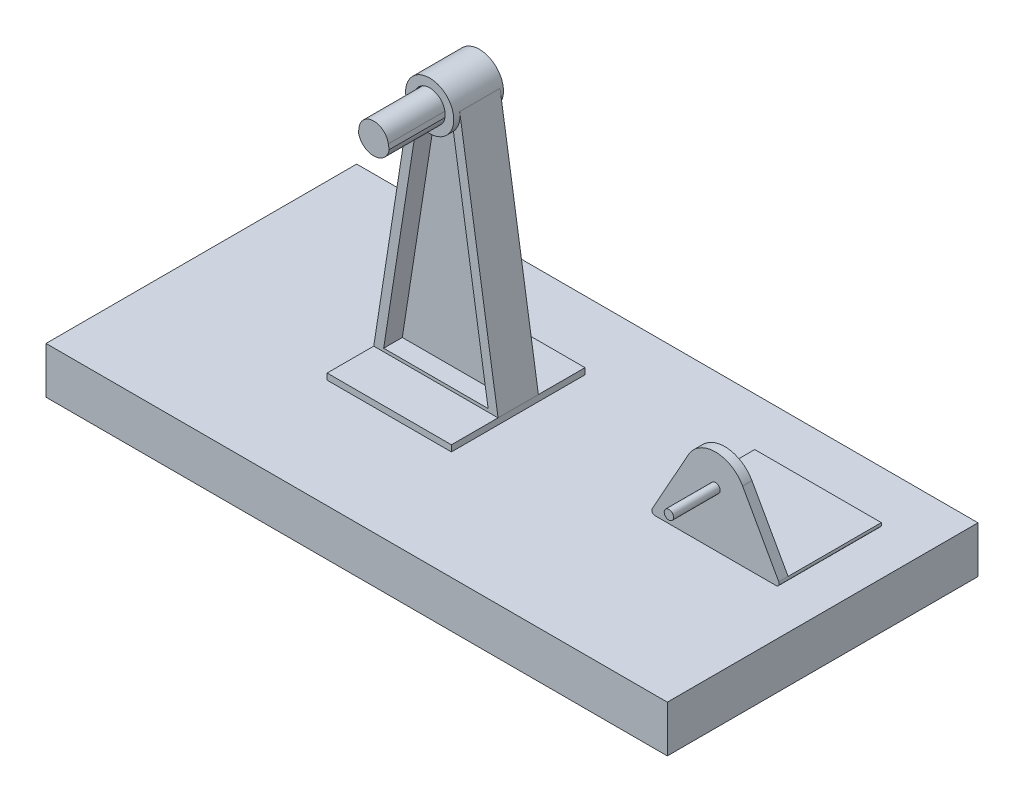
ISO-10303-21;
HEADER;
FILE_DESCRIPTION(('STEP AP214'),'2;1');
FILE_NAME('part.step','',(''),(''),'','','');
FILE_SCHEMA(('AUTOMOTIVE_DESIGN { 1 0 10303 214 1 1 1 1 }'));
ENDSEC;
DATA;
#1=APPLICATION_CONTEXT('core data for automotive mechanical design processes');
#2=APPLICATION_PROTOCOL_DEFINITION('international standard','automotive_design',2000,#1);
#3=PRODUCT_CONTEXT('',#1,'mechanical');
#4=PRODUCT('Part','Part','',(#3));
#5=PRODUCT_RELATED_PRODUCT_CATEGORY('part','',(#4));
#6=PRODUCT_DEFINITION_FORMATION('','',#4);
#7=PRODUCT_DEFINITION_CONTEXT('part definition',#1,'design');
#8=PRODUCT_DEFINITION('design','',#6,#7);
#9=PRODUCT_DEFINITION_SHAPE('','',#8);
#10=(LENGTH_UNIT() NAMED_UNIT(*) SI_UNIT(.MILLI.,.METRE.));
#11=(NAMED_UNIT(*) PLANE_ANGLE_UNIT() SI_UNIT($,.RADIAN.));
#12=(NAMED_UNIT(*) SI_UNIT($,.STERADIAN.) SOLID_ANGLE_UNIT());
#13=UNCERTAINTY_MEASURE_WITH_UNIT(LENGTH_MEASURE(1.E-05),#10,'distance_accuracy_value','');
#14=(GEOMETRIC_REPRESENTATION_CONTEXT(3) GLOBAL_UNCERTAINTY_ASSIGNED_CONTEXT((#13)) GLOBAL_UNIT_ASSIGNED_CONTEXT((#10,
#11,#12)) REPRESENTATION_CONTEXT('',''));
#15=CARTESIAN_POINT('',(0.,0.,0.));
#16=DIRECTION('',(0.,0.,1.));
#17=DIRECTION('',(1.,0.,0.));
#18=AXIS2_PLACEMENT_3D('',#15,#16,#17);
#19=CARTESIAN_POINT('',(-100.,7.5,50.));
#20=DIRECTION('',(0.,-1.,0.));
#21=DIRECTION('',(0.,0.,-1.));
#22=AXIS2_PLACEMENT_3D('',#19,#20,#21);
#23=PLANE('',#22);
#24=DIRECTION('',(-1.,0.,0.));
#25=VECTOR('',#24,1.);
#26=CARTESIAN_POINT('',(-100.,7.5,-50.));
#27=LINE('',#26,#25);
#28=CARTESIAN_POINT('',(100.,7.5,-50.));
#29=VERTEX_POINT('',#28);
#30=CARTESIAN_POINT('',(-100.,7.5,-50.));
#31=VERTEX_POINT('',#30);
#32=EDGE_CURVE('E660',#29,#31,#27,.T.);
#33=ORIENTED_EDGE('',*,*,#32,.T.);
#34=DIRECTION('',(0.,0.,-1.));
#35=VECTOR('',#34,1.);
#36=CARTESIAN_POINT('',(-100.,7.5,50.));
#37=LINE('',#36,#35);
#38=CARTESIAN_POINT('',(-100.,7.5,50.));
#39=VERTEX_POINT('',#38);
#40=EDGE_CURVE('E675',#39,#31,#37,.T.);
#41=ORIENTED_EDGE('',*,*,#40,.F.);
#42=DIRECTION('',(-1.,0.,0.));
#43=VECTOR('',#42,1.);
#44=CARTESIAN_POINT('',(-100.,7.5,50.));
#45=LINE('',#44,#43);
#46=CARTESIAN_POINT('',(100.,7.5,50.));
#47=VERTEX_POINT('',#46);
#48=EDGE_CURVE('E646',#47,#39,#45,.T.);
#49=ORIENTED_EDGE('',*,*,#48,.F.);
#50=DIRECTION('',(0.,0.,-1.));
#51=VECTOR('',#50,1.);
#52=CARTESIAN_POINT('',(100.,7.5,50.));
#53=LINE('',#52,#51);
#54=EDGE_CURVE('E679',#47,#29,#53,.T.);
#55=ORIENTED_EDGE('',*,*,#54,.T.);
#56=EDGE_LOOP('',(#33,#41,#49,#55));
#57=FACE_BOUND('',#56,.T.);
#58=DIRECTION('',(0.,0.,1.));
#59=VECTOR('',#58,1.);
#60=CARTESIAN_POINT('',(46.,7.5,-3.));
#61=LINE('',#60,#59);
#62=CARTESIAN_POINT('',(46.,7.5,-33.));
#63=VERTEX_POINT('',#62);
#64=CARTESIAN_POINT('',(46.,7.5,0.));
#65=VERTEX_POINT('',#64);
#66=EDGE_CURVE('E633',#63,#65,#61,.T.);
#67=ORIENTED_EDGE('',*,*,#66,.F.);
#68=DIRECTION('',(-1.,0.,0.));
#69=VECTOR('',#68,1.);
#70=CARTESIAN_POINT('',(46.,7.5,-33.));
#71=LINE('',#70,#69);
#72=CARTESIAN_POINT('',(85.,7.50000000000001,-33.));
#73=VERTEX_POINT('',#72);
#74=EDGE_CURVE('E573',#73,#63,#71,.T.);
#75=ORIENTED_EDGE('',*,*,#74,.F.);
#76=DIRECTION('',(0.,0.,1.));
#77=VECTOR('',#76,1.);
#78=CARTESIAN_POINT('',(85.,7.5,-3.));
#79=LINE('',#78,#77);
#80=CARTESIAN_POINT('',(85.,7.5,0.));
#81=VERTEX_POINT('',#80);
#82=EDGE_CURVE('E630',#73,#81,#79,.T.);
#83=ORIENTED_EDGE('',*,*,#82,.T.);
#84=DIRECTION('',(1.,0.,0.));
#85=VECTOR('',#84,1.);
#86=CARTESIAN_POINT('',(85.,7.5,0.));
#87=LINE('',#86,#85);
#88=EDGE_CURVE('E612',#65,#81,#87,.T.);
#89=ORIENTED_EDGE('',*,*,#88,.F.);
#90=EDGE_LOOP('',(#67,#75,#83,#89));
#91=FACE_BOUND('',#90,.T.);
#92=DIRECTION('',(-1.,0.,0.));
#93=VECTOR('',#92,1.);
#94=CARTESIAN_POINT('',(-4.49999999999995,7.50000000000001,-28.));
#95=LINE('',#94,#93);
#96=CARTESIAN_POINT('',(-4.49999999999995,7.5,-28.));
#97=VERTEX_POINT('',#96);
#98=CARTESIAN_POINT('',(-44.5,7.5,-28.));
#99=VERTEX_POINT('',#98);
#100=EDGE_CURVE('E292',#97,#99,#95,.T.);
#101=ORIENTED_EDGE('',*,*,#100,.F.);
#102=DIRECTION('',(0.,0.,1.));
#103=VECTOR('',#102,1.);
#104=CARTESIAN_POINT('',(-4.49999999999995,7.50000000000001,-13.));
#105=LINE('',#104,#103);
#106=CARTESIAN_POINT('',(-4.49999999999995,7.50000000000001,15.));
#107=VERTEX_POINT('',#106);
#108=EDGE_CURVE('E99',#97,#107,#105,.T.);
#109=ORIENTED_EDGE('',*,*,#108,.T.);
#110=DIRECTION('',(1.,0.,0.));
#111=VECTOR('',#110,1.);
#112=CARTESIAN_POINT('',(-44.5,7.50000000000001,15.));
#113=LINE('',#112,#111);
#114=CARTESIAN_POINT('',(-44.5,7.50000000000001,15.));
#115=VERTEX_POINT('',#114);
#116=EDGE_CURVE('E326',#115,#107,#113,.T.);
#117=ORIENTED_EDGE('',*,*,#116,.F.);
#118=DIRECTION('',(0.,0.,1.));
#119=VECTOR('',#118,1.);
#120=CARTESIAN_POINT('',(-44.5,7.5,-13.));
#121=LINE('',#120,#119);
#122=EDGE_CURVE('E91',#99,#115,#121,.T.);
#123=ORIENTED_EDGE('',*,*,#122,.F.);
#124=EDGE_LOOP('',(#101,#109,#117,#123));
#125=FACE_BOUND('',#124,.T.);
#126=ADVANCED_FACE('F74',(#57,#91,#125),#23,.F.);
#127=CARTESIAN_POINT('',(0.,0.,-13.));
#128=DIRECTION('',(0.,0.,1.));
#129=DIRECTION('',(1.,0.,0.));
#130=AXIS2_PLACEMENT_3D('',#127,#128,#129);
#131=PLANE('',#130);
#132=DIRECTION('',(0.153992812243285,0.98807196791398,0.));
#133=VECTOR('',#132,1.);
#134=CARTESIAN_POINT('',(-41.3079320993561,10.5,-13.));
#135=LINE('',#134,#133);
#136=CARTESIAN_POINT('',(-41.3079320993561,10.5,-13.));
#137=VERTEX_POINT('',#136);
#138=CARTESIAN_POINT('',(-30.6783911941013,78.702867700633,-13.));
#139=VERTEX_POINT('',#138);
#140=EDGE_CURVE('E451',#137,#139,#135,.T.);
#141=ORIENTED_EDGE('',*,*,#140,.F.);
#142=DIRECTION('',(-1.,0.,0.));
#143=VECTOR('',#142,1.);
#144=CARTESIAN_POINT('',(-7.69206790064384,10.5,-13.));
#145=LINE('',#144,#143);
#146=CARTESIAN_POINT('',(-7.69206790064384,10.5,-13.));
#147=VERTEX_POINT('',#146);
#148=EDGE_CURVE('E429',#147,#137,#145,.T.);
#149=ORIENTED_EDGE('',*,*,#148,.F.);
#150=DIRECTION('',(0.1539928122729,-0.988071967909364,0.));
#151=VECTOR('',#150,1.);
#152=CARTESIAN_POINT('',(-18.3216088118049,78.7028677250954,-13.));
#153=LINE('',#152,#151);
#154=CARTESIAN_POINT('',(-18.3216088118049,78.7028677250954,-13.));
#155=VERTEX_POINT('',#154);
#156=EDGE_CURVE('E404',#155,#147,#153,.T.);
#157=ORIENTED_EDGE('',*,*,#156,.F.);
#158=CARTESIAN_POINT('',(-30.6783911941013,78.702867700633,-13.));
#159=CARTESIAN_POINT('',(-30.4815497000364,78.5646307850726,-13.));
#160=CARTESIAN_POINT('',(-30.2808441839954,78.4318933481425,-13.));
#161=CARTESIAN_POINT('',(-30.076484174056,78.3047948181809,-13.));
#162=CARTESIAN_POINT('',(-29.5436230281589,77.9937011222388,-13.));
#163=CARTESIAN_POINT('',(-28.9894878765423,77.7215185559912,-13.));
#164=CARTESIAN_POINT('',(-28.6444176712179,77.5703471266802,-13.));
#165=CARTESIAN_POINT('',(-27.9419646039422,77.2985066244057,-13.));
#166=CARTESIAN_POINT('',(-27.2184067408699,77.0892135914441,-13.));
#167=CARTESIAN_POINT('',(-26.8522861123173,77.0004305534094,-13.));
#168=CARTESIAN_POINT('',(-26.1132304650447,76.8550446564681,-13.));
#169=CARTESIAN_POINT('',(-25.3642840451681,76.7749255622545,-13.));
#170=CARTESIAN_POINT('',(-24.988297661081,76.7512431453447,-13.));
#171=CARTESIAN_POINT('',(-24.2352175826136,76.7367534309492,-13.));
#172=CARTESIAN_POINT('',(-23.4837609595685,76.788255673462,-13.));
#173=CARTESIAN_POINT('',(-23.1093938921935,76.8303972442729,-13.));
#174=CARTESIAN_POINT('',(-22.3652930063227,76.9472462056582,-13.));
#175=CARTESIAN_POINT('',(-21.6342801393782,77.1287966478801,-13.));
#176=CARTESIAN_POINT('',(-21.2729679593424,77.2354749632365,-13.));
#177=CARTESIAN_POINT('',(-20.5605766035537,77.4800932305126,-13.));
#178=CARTESIAN_POINT('',(-19.87234025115,77.7861456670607,-13.));
#179=CARTESIAN_POINT('',(-19.5351208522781,77.9541018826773,-13.));
#180=CARTESIAN_POINT('',(-19.0876481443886,78.2019155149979,-13.));
#181=CARTESIAN_POINT('',(-18.6560746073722,78.4756894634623,-13.));
#182=CARTESIAN_POINT('',(-18.5433970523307,78.549671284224,-13.));
#183=CARTESIAN_POINT('',(-18.431896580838,78.6254061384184,-13.));
#184=CARTESIAN_POINT('',(-18.3216088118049,78.7028677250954,-13.));
#185=B_SPLINE_CURVE_WITH_KNOTS('',5,(#158,#159,#160,#161,#162,#163,#164,#165,#166,#167,#168,
#169,#170,#171,#172,#173,#174,#175,#176,#177,#178,#179,#180,#181,#182,#183,#184),.UNSPECIFIED.,
.F.,.F.,(6,3,3,3,3,3,3,3,6),(0.,0.0913598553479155,0.234268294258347,0.377176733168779,
0.520085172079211,0.662993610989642,0.805902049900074,0.948810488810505,1.),.UNSPECIFIED.);
#186=EDGE_CURVE('E391',#139,#155,#185,.T.);
#187=ORIENTED_EDGE('',*,*,#186,.F.);
#188=EDGE_LOOP('',(#141,#149,#157,#187));
#189=FACE_BOUND('',#188,.T.);
#190=DIRECTION('',(1.,0.,0.));
#191=VECTOR('',#190,1.);
#192=CARTESIAN_POINT('',(-4.49999999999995,9.5,-13.));
#193=LINE('',#192,#191);
#194=CARTESIAN_POINT('',(-44.5,9.5,-13.));
#195=VERTEX_POINT('',#194);
#196=CARTESIAN_POINT('',(-4.49999999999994,9.50000000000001,-13.));
#197=VERTEX_POINT('',#196);
#198=EDGE_CURVE('E318',#195,#197,#193,.T.);
#199=ORIENTED_EDGE('',*,*,#198,.F.);
#200=DIRECTION('',(0.153992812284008,0.988071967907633,0.));
#201=VECTOR('',#200,1.);
#202=CARTESIAN_POINT('',(-44.8902183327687,6.99622212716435,-13.));
#203=LINE('',#202,#201);
#204=CARTESIAN_POINT('',(-32.1575577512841,88.6934442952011,-13.));
#205=VERTEX_POINT('',#204);
#206=EDGE_CURVE('E525',#195,#205,#203,.T.);
#207=ORIENTED_EDGE('',*,*,#206,.T.);
#208=CARTESIAN_POINT('',(-24.5,87.5,-13.));
#209=DIRECTION('',(0.,0.,1.));
#210=DIRECTION('',(1.,0.,0.));
#211=AXIS2_PLACEMENT_3D('',#208,#209,#210);
#212=CIRCLE('',#211,7.75000000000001);
#213=CARTESIAN_POINT('',(-16.8424422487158,88.6934442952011,-13.));
#214=VERTEX_POINT('',#213);
#215=EDGE_CURVE('E486',#205,#214,#212,.T.);
#216=ORIENTED_EDGE('',*,*,#215,.T.);
#217=DIRECTION('',(0.153992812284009,-0.988071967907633,0.));
#218=VECTOR('',#217,1.);
#219=CARTESIAN_POINT('',(-2.94780614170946,-0.459420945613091,-13.));
#220=LINE('',#219,#218);
#221=EDGE_CURVE('E529',#214,#197,#220,.T.);
#222=ORIENTED_EDGE('',*,*,#221,.T.);
#223=EDGE_LOOP('',(#199,#207,#216,#222));
#224=FACE_BOUND('',#223,.T.);
#225=ADVANCED_FACE('F720',(#189,#224),#131,.F.);
#226=CARTESIAN_POINT('',(0.,0.,0.));
#227=DIRECTION('',(0.,0.,1.));
#228=DIRECTION('',(1.,0.,0.));
#229=AXIS2_PLACEMENT_3D('',#226,#227,#228);
#230=PLANE('',#229);
#231=DIRECTION('',(0.153992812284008,0.988071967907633,0.));
#232=VECTOR('',#231,1.);
#233=CARTESIAN_POINT('',(-44.8902183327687,6.99622212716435,0.));
#234=LINE('',#233,#232);
#235=CARTESIAN_POINT('',(-44.5,9.5,0.));
#236=VERTEX_POINT('',#235);
#237=CARTESIAN_POINT('',(-32.1575577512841,88.6934442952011,0.));
#238=VERTEX_POINT('',#237);
#239=EDGE_CURVE('E521',#236,#238,#234,.T.);
#240=ORIENTED_EDGE('',*,*,#239,.F.);
#241=DIRECTION('',(-1.,0.,0.));
#242=VECTOR('',#241,1.);
#243=CARTESIAN_POINT('',(-44.5,9.5,0.));
#244=LINE('',#243,#242);
#245=CARTESIAN_POINT('',(-4.49999999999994,9.50000000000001,0.));
#246=VERTEX_POINT('',#245);
#247=EDGE_CURVE('E307',#246,#236,#244,.T.);
#248=ORIENTED_EDGE('',*,*,#247,.F.);
#249=DIRECTION('',(0.153992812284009,-0.988071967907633,0.));
#250=VECTOR('',#249,1.);
#251=CARTESIAN_POINT('',(-2.94780614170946,-0.459420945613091,0.));
#252=LINE('',#251,#250);
#253=CARTESIAN_POINT('',(-16.8424422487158,88.6934442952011,0.));
#254=VERTEX_POINT('',#253);
#255=EDGE_CURVE('E530',#254,#246,#252,.T.);
#256=ORIENTED_EDGE('',*,*,#255,.F.);
#257=CARTESIAN_POINT('',(-24.5,87.5,0.));
#258=DIRECTION('',(0.,0.,1.));
#259=DIRECTION('',(1.,0.,0.));
#260=AXIS2_PLACEMENT_3D('',#257,#258,#259);
#261=CIRCLE('',#260,7.75000000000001);
#262=CARTESIAN_POINT('',(-18.8636486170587,82.1807854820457,0.));
#263=VERTEX_POINT('',#262);
#264=EDGE_CURVE('E481',#263,#254,#261,.T.);
#265=ORIENTED_EDGE('',*,*,#264,.F.);
#266=DIRECTION('',(-0.153992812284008,0.988071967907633,0.));
#267=VECTOR('',#266,1.);
#268=CARTESIAN_POINT('',(-7.69206790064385,10.5,0.));
#269=LINE('',#268,#267);
#270=CARTESIAN_POINT('',(-7.69206790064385,10.5,0.));
#271=VERTEX_POINT('',#270);
#272=EDGE_CURVE('E494',#271,#263,#269,.T.);
#273=ORIENTED_EDGE('',*,*,#272,.F.);
#274=DIRECTION('',(1.,0.,0.));
#275=VECTOR('',#274,1.);
#276=CARTESIAN_POINT('',(-41.3079320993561,10.5,0.));
#277=LINE('',#276,#275);
#278=CARTESIAN_POINT('',(-41.3079320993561,10.5,0.));
#279=VERTEX_POINT('',#278);
#280=EDGE_CURVE('E510',#279,#271,#277,.T.);
#281=ORIENTED_EDGE('',*,*,#280,.F.);
#282=DIRECTION('',(-0.153992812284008,-0.988071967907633,0.));
#283=VECTOR('',#282,1.);
#284=CARTESIAN_POINT('',(-29.1933418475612,88.231465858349,0.));
#285=LINE('',#284,#283);
#286=CARTESIAN_POINT('',(-30.1363513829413,82.1807854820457,0.));
#287=VERTEX_POINT('',#286);
#288=EDGE_CURVE('E505',#287,#279,#285,.T.);
#289=ORIENTED_EDGE('',*,*,#288,.F.);
#290=EDGE_CURVE('E485',#238,#287,#261,.T.);
#291=ORIENTED_EDGE('',*,*,#290,.F.);
#292=EDGE_LOOP('',(#240,#248,#256,#265,#273,#281,#289,#291));
#293=FACE_BOUND('',#292,.T.);
#294=ADVANCED_FACE('F712',(#293),#230,.T.);
#295=CARTESIAN_POINT('',(-24.5,87.5,-14.));
#296=DIRECTION('',(0.,0.,1.));
#297=DIRECTION('',(1.,0.,0.));
#298=AXIS2_PLACEMENT_3D('',#295,#296,#297);
#299=CYLINDRICAL_SURFACE('',#298,5.);
#300=DIRECTION('',(0.,0.,-1.));
#301=VECTOR('',#300,1.);
#302=CARTESIAN_POINT('',(-29.4337630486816,86.6888389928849,20.));
#303=LINE('',#302,#301);
#304=CARTESIAN_POINT('',(-29.4337630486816,86.6888389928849,2.));
#305=VERTEX_POINT('',#304);
#306=CARTESIAN_POINT('',(-29.4337630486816,86.6888389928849,0.));
#307=VERTEX_POINT('',#306);
#308=EDGE_CURVE('E366',#305,#307,#303,.T.);
#309=ORIENTED_EDGE('',*,*,#308,.T.);
#310=CARTESIAN_POINT('',(-24.5,87.5,0.));
#311=DIRECTION('',(0.,0.,1.));
#312=DIRECTION('',(1.,0.,0.));
#313=AXIS2_PLACEMENT_3D('',#310,#311,#312);
#314=CIRCLE('',#313,5.);
#315=CARTESIAN_POINT('',(-19.5662369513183,86.6888389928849,0.));
#316=VERTEX_POINT('',#315);
#317=EDGE_CURVE('E470',#316,#307,#314,.T.);
#318=ORIENTED_EDGE('',*,*,#317,.F.);
#319=DIRECTION('',(0.,0.,-1.));
#320=VECTOR('',#319,1.);
#321=CARTESIAN_POINT('',(-19.5662369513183,86.6888389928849,20.));
#322=LINE('',#321,#320);
#323=CARTESIAN_POINT('',(-19.5662369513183,86.6888389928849,2.));
#324=VERTEX_POINT('',#323);
#325=EDGE_CURVE('E361',#324,#316,#322,.T.);
#326=ORIENTED_EDGE('',*,*,#325,.F.);
#327=CARTESIAN_POINT('',(-24.5,87.5,2.));
#328=DIRECTION('',(0.,0.,1.));
#329=DIRECTION('',(1.,0.,0.));
#330=AXIS2_PLACEMENT_3D('',#327,#328,#329);
#331=CIRCLE('',#330,5.);
#332=EDGE_CURVE('E396',#324,#305,#331,.T.);
#333=ORIENTED_EDGE('',*,*,#332,.T.);
#334=EDGE_LOOP('',(#309,#318,#326,#333));
#335=FACE_BOUND('',#334,.T.);
#336=ADVANCED_FACE('F741',(#335),#299,.F.);
#337=CARTESIAN_POINT('',(65.5,25.,-3.));
#338=DIRECTION('',(0.,0.,-1.));
#339=DIRECTION('',(-1.,0.,0.));
#340=AXIS2_PLACEMENT_3D('',#337,#338,#339);
#341=PLANE('',#340);
#342=DIRECTION('',(-0.486847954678,0.873486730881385,0.));
#343=VECTOR('',#342,1.);
#344=CARTESIAN_POINT('',(74.2348673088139,29.86847954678,-3.));
#345=LINE('',#344,#343);
#346=CARTESIAN_POINT('',(85.8734867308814,8.98684795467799,-3.));
#347=VERTEX_POINT('',#346);
#348=CARTESIAN_POINT('',(74.2348673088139,29.86847954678,-3.));
#349=VERTEX_POINT('',#348);
#350=EDGE_CURVE('E596',#347,#349,#345,.T.);
#351=ORIENTED_EDGE('',*,*,#350,.F.);
#352=DIRECTION('',(1.,0.,0.));
#353=VECTOR('',#352,1.);
#354=CARTESIAN_POINT('',(45.1265132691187,8.986847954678,-3.));
#355=LINE('',#354,#353);
#356=CARTESIAN_POINT('',(45.1265132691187,8.986847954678,-3.));
#357=VERTEX_POINT('',#356);
#358=EDGE_CURVE('E561',#357,#347,#355,.T.);
#359=ORIENTED_EDGE('',*,*,#358,.F.);
#360=DIRECTION('',(-0.486847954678,-0.873486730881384,0.));
#361=VECTOR('',#360,1.);
#362=CARTESIAN_POINT('',(45.1265132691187,8.986847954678,-3.));
#363=LINE('',#362,#361);
#364=CARTESIAN_POINT('',(56.7651326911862,29.86847954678,-3.));
#365=VERTEX_POINT('',#364);
#366=EDGE_CURVE('E591',#365,#357,#363,.T.);
#367=ORIENTED_EDGE('',*,*,#366,.F.);
#368=CARTESIAN_POINT('',(65.5,25.,-3.));
#369=DIRECTION('',(0.,0.,1.));
#370=DIRECTION('',(-1.,0.,0.));
#371=AXIS2_PLACEMENT_3D('',#368,#369,#370);
#372=CIRCLE('',#371,9.99999999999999);
#373=EDGE_CURVE('E587',#349,#365,#372,.T.);
#374=ORIENTED_EDGE('',*,*,#373,.F.);
#375=EDGE_LOOP('',(#351,#359,#367,#374));
#376=FACE_BOUND('',#375,.T.);
#377=ADVANCED_FACE('F824',(#376),#341,.T.);
#378=CARTESIAN_POINT('',(100.,7.5,50.));
#379=DIRECTION('',(-1.,0.,0.));
#380=DIRECTION('',(0.,0.,1.));
#381=AXIS2_PLACEMENT_3D('',#378,#379,#380);
#382=PLANE('',#381);
#383=DIRECTION('',(0.,1.,0.));
#384=VECTOR('',#383,1.);
#385=CARTESIAN_POINT('',(100.,7.5,-50.));
#386=LINE('',#385,#384);
#387=CARTESIAN_POINT('',(100.,-7.5,-50.));
#388=VERTEX_POINT('',#387);
#389=EDGE_CURVE('E626',#388,#29,#386,.T.);
#390=ORIENTED_EDGE('',*,*,#389,.T.);
#391=ORIENTED_EDGE('',*,*,#54,.F.);
#392=DIRECTION('',(0.,1.,0.));
#393=VECTOR('',#392,1.);
#394=CARTESIAN_POINT('',(100.,7.5,50.));
#395=LINE('',#394,#393);
#396=CARTESIAN_POINT('',(100.,-7.5,50.));
#397=VERTEX_POINT('',#396);
#398=EDGE_CURVE('E642',#397,#47,#395,.T.);
#399=ORIENTED_EDGE('',*,*,#398,.F.);
#400=DIRECTION('',(0.,0.,-1.));
#401=VECTOR('',#400,1.);
#402=CARTESIAN_POINT('',(100.,-7.5,50.));
#403=LINE('',#402,#401);
#404=EDGE_CURVE('E656',#397,#388,#403,.T.);
#405=ORIENTED_EDGE('',*,*,#404,.T.);
#406=EDGE_LOOP('',(#390,#391,#399,#405));
#407=FACE_BOUND('',#406,.T.);
#408=ADVANCED_FACE('F76',(#407),#382,.F.);
#409=CARTESIAN_POINT('',(-100.,7.5,50.));
#410=DIRECTION('',(1.,0.,0.));
#411=DIRECTION('',(0.,0.,-1.));
#412=AXIS2_PLACEMENT_3D('',#409,#410,#411);
#413=PLANE('',#412);
#414=DIRECTION('',(0.,-1.,0.));
#415=VECTOR('',#414,1.);
#416=CARTESIAN_POINT('',(-100.,7.5,-50.));
#417=LINE('',#416,#415);
#418=CARTESIAN_POINT('',(-100.,-7.5,-50.));
#419=VERTEX_POINT('',#418);
#420=EDGE_CURVE('E663',#31,#419,#417,.T.);
#421=ORIENTED_EDGE('',*,*,#420,.T.);
#422=DIRECTION('',(0.,0.,-1.));
#423=VECTOR('',#422,1.);
#424=CARTESIAN_POINT('',(-100.,-7.5,50.));
#425=LINE('',#424,#423);
#426=CARTESIAN_POINT('',(-100.,-7.5,50.));
#427=VERTEX_POINT('',#426);
#428=EDGE_CURVE('E671',#427,#419,#425,.T.);
#429=ORIENTED_EDGE('',*,*,#428,.F.);
#430=DIRECTION('',(0.,-1.,0.));
#431=VECTOR('',#430,1.);
#432=CARTESIAN_POINT('',(-100.,7.5,50.));
#433=LINE('',#432,#431);
#434=EDGE_CURVE('E650',#39,#427,#433,.T.);
#435=ORIENTED_EDGE('',*,*,#434,.F.);
#436=ORIENTED_EDGE('',*,*,#40,.T.);
#437=EDGE_LOOP('',(#421,#429,#435,#436));
#438=FACE_BOUND('',#437,.T.);
#439=ADVANCED_FACE('F783',(#438),#413,.F.);
#440=CARTESIAN_POINT('',(-100.,-7.5,50.));
#441=DIRECTION('',(0.,1.,0.));
#442=DIRECTION('',(0.,0.,1.));
#443=AXIS2_PLACEMENT_3D('',#440,#441,#442);
#444=PLANE('',#443);
#445=DIRECTION('',(1.,0.,0.));
#446=VECTOR('',#445,1.);
#447=CARTESIAN_POINT('',(-100.,-7.5,-50.));
#448=LINE('',#447,#446);
#449=EDGE_CURVE('E647',#419,#388,#448,.T.);
#450=ORIENTED_EDGE('',*,*,#449,.T.);
#451=ORIENTED_EDGE('',*,*,#404,.F.);
#452=DIRECTION('',(1.,0.,0.));
#453=VECTOR('',#452,1.);
#454=CARTESIAN_POINT('',(-100.,-7.5,50.));
#455=LINE('',#454,#453);
#456=EDGE_CURVE('E653',#427,#397,#455,.T.);
#457=ORIENTED_EDGE('',*,*,#456,.F.);
#458=ORIENTED_EDGE('',*,*,#428,.T.);
#459=EDGE_LOOP('',(#450,#451,#457,#458));
#460=FACE_BOUND('',#459,.T.);
#461=ADVANCED_FACE('F786',(#460),#444,.F.);
#462=CARTESIAN_POINT('',(0.,0.,50.));
#463=DIRECTION('',(0.,0.,1.));
#464=DIRECTION('',(1.,0.,0.));
#465=AXIS2_PLACEMENT_3D('',#462,#463,#464);
#466=PLANE('',#465);
#467=ORIENTED_EDGE('',*,*,#398,.T.);
#468=ORIENTED_EDGE('',*,*,#48,.T.);
#469=ORIENTED_EDGE('',*,*,#434,.T.);
#470=ORIENTED_EDGE('',*,*,#456,.T.);
#471=EDGE_LOOP('',(#467,#468,#469,#470));
#472=FACE_BOUND('',#471,.T.);
#473=ADVANCED_FACE('F790',(#472),#466,.T.);
#474=CARTESIAN_POINT('',(0.,0.,-50.));
#475=DIRECTION('',(0.,0.,1.));
#476=DIRECTION('',(1.,0.,0.));
#477=AXIS2_PLACEMENT_3D('',#474,#475,#476);
#478=PLANE('',#477);
#479=ORIENTED_EDGE('',*,*,#389,.F.);
#480=ORIENTED_EDGE('',*,*,#449,.F.);
#481=ORIENTED_EDGE('',*,*,#420,.F.);
#482=ORIENTED_EDGE('',*,*,#32,.F.);
#483=EDGE_LOOP('',(#479,#480,#481,#482));
#484=FACE_BOUND('',#483,.T.);
#485=ADVANCED_FACE('F792',(#484),#478,.F.);
#486=CARTESIAN_POINT('',(65.5,25.,-3.));
#487=DIRECTION('',(0.,0.,1.));
#488=DIRECTION('',(1.,0.,0.));
#489=AXIS2_PLACEMENT_3D('',#486,#487,#488);
#490=CYLINDRICAL_SURFACE('',#489,9.99999999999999);
#491=CARTESIAN_POINT('',(65.5,25.,0.));
#492=DIRECTION('',(0.,0.,1.));
#493=DIRECTION('',(-1.,0.,0.));
#494=AXIS2_PLACEMENT_3D('',#491,#492,#493);
#495=CIRCLE('',#494,9.99999999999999);
#496=CARTESIAN_POINT('',(74.2348673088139,29.86847954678,0.));
#497=VERTEX_POINT('',#496);
#498=CARTESIAN_POINT('',(56.7651326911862,29.86847954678,0.));
#499=VERTEX_POINT('',#498);
#500=EDGE_CURVE('E586',#497,#499,#495,.T.);
#501=ORIENTED_EDGE('',*,*,#500,.F.);
#502=DIRECTION('',(0.,0.,1.));
#503=VECTOR('',#502,1.);
#504=CARTESIAN_POINT('',(74.2348673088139,29.86847954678,-3.));
#505=LINE('',#504,#503);
#506=EDGE_CURVE('E623',#349,#497,#505,.T.);
#507=ORIENTED_EDGE('',*,*,#506,.F.);
#508=ORIENTED_EDGE('',*,*,#373,.T.);
#509=DIRECTION('',(0.,0.,1.));
#510=VECTOR('',#509,1.);
#511=CARTESIAN_POINT('',(56.7651326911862,29.86847954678,-3.));
#512=LINE('',#511,#510);
#513=EDGE_CURVE('E600',#365,#499,#512,.T.);
#514=ORIENTED_EDGE('',*,*,#513,.T.);
#515=EDGE_LOOP('',(#501,#507,#508,#514));
#516=FACE_BOUND('',#515,.T.);
#517=ADVANCED_FACE('F795',(#516),#490,.T.);
#518=CARTESIAN_POINT('',(74.2348673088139,29.86847954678,-3.));
#519=DIRECTION('',(0.873486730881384,0.486847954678,0.));
#520=DIRECTION('',(-0.486847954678,0.873486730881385,0.));
#521=AXIS2_PLACEMENT_3D('',#518,#519,#520);
#522=PLANE('',#521);
#523=DIRECTION('',(-0.486847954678,0.873486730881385,0.));
#524=VECTOR('',#523,1.);
#525=CARTESIAN_POINT('',(74.2348673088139,29.86847954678,0.));
#526=LINE('',#525,#524);
#527=CARTESIAN_POINT('',(85.8734867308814,8.98684795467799,0.));
#528=VERTEX_POINT('',#527);
#529=EDGE_CURVE('E592',#528,#497,#526,.T.);
#530=ORIENTED_EDGE('',*,*,#529,.F.);
#531=DIRECTION('',(0.,0.,1.));
#532=VECTOR('',#531,1.);
#533=CARTESIAN_POINT('',(85.8734867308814,8.98684795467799,-3.));
#534=LINE('',#533,#532);
#535=EDGE_CURVE('E627',#347,#528,#534,.T.);
#536=ORIENTED_EDGE('',*,*,#535,.F.);
#537=ORIENTED_EDGE('',*,*,#350,.T.);
#538=ORIENTED_EDGE('',*,*,#506,.T.);
#539=EDGE_LOOP('',(#530,#536,#537,#538));
#540=FACE_BOUND('',#539,.T.);
#541=ADVANCED_FACE('F802',(#540),#522,.T.);
#542=CARTESIAN_POINT('',(85.,8.5,-3.));
#543=DIRECTION('',(0.,0.,1.));
#544=DIRECTION('',(1.,0.,0.));
#545=AXIS2_PLACEMENT_3D('',#542,#543,#544);
#546=CYLINDRICAL_SURFACE('',#545,0.999999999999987);
#547=CARTESIAN_POINT('',(85.,8.5,0.));
#548=DIRECTION('',(0.,0.,1.));
#549=DIRECTION('',(1.,0.,0.));
#550=AXIS2_PLACEMENT_3D('',#547,#548,#549);
#551=CIRCLE('',#550,0.999999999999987);
#552=EDGE_CURVE('E616',#81,#528,#551,.T.);
#553=ORIENTED_EDGE('',*,*,#552,.F.);
#554=ORIENTED_EDGE('',*,*,#82,.F.);
#555=CARTESIAN_POINT('',(85.,8.5,-33.));
#556=DIRECTION('',(0.,0.,-1.));
#557=DIRECTION('',(-1.,0.,0.));
#558=AXIS2_PLACEMENT_3D('',#555,#556,#557);
#559=CIRCLE('',#558,0.999999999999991);
#560=CARTESIAN_POINT('',(85.8734867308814,8.98684795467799,-33.));
#561=VERTEX_POINT('',#560);
#562=EDGE_CURVE('E569',#561,#73,#559,.T.);
#563=ORIENTED_EDGE('',*,*,#562,.F.);
#564=DIRECTION('',(0.,0.,1.));
#565=VECTOR('',#564,1.);
#566=CARTESIAN_POINT('',(85.8734867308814,8.98684795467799,-33.));
#567=LINE('',#566,#565);
#568=EDGE_CURVE('E577',#561,#347,#567,.T.);
#569=ORIENTED_EDGE('',*,*,#568,.T.);
#570=ORIENTED_EDGE('',*,*,#535,.T.);
#571=EDGE_LOOP('',(#553,#554,#563,#569,#570));
#572=FACE_BOUND('',#571,.T.);
#573=ADVANCED_FACE('F812',(#572),#546,.T.);
#574=CARTESIAN_POINT('',(46.,8.5,-3.));
#575=DIRECTION('',(0.,0.,1.));
#576=DIRECTION('',(1.,0.,0.));
#577=AXIS2_PLACEMENT_3D('',#574,#575,#576);
#578=CYLINDRICAL_SURFACE('',#577,1.);
#579=CARTESIAN_POINT('',(46.,8.5,0.));
#580=DIRECTION('',(0.,0.,1.));
#581=DIRECTION('',(-1.,0.,0.));
#582=AXIS2_PLACEMENT_3D('',#579,#580,#581);
#583=CIRCLE('',#582,1.);
#584=CARTESIAN_POINT('',(45.1265132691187,8.986847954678,0.));
#585=VERTEX_POINT('',#584);
#586=EDGE_CURVE('E608',#585,#65,#583,.T.);
#587=ORIENTED_EDGE('',*,*,#586,.F.);
#588=DIRECTION('',(0.,0.,1.));
#589=VECTOR('',#588,1.);
#590=CARTESIAN_POINT('',(45.1265132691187,8.986847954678,-3.));
#591=LINE('',#590,#589);
#592=EDGE_CURVE('E637',#357,#585,#591,.T.);
#593=ORIENTED_EDGE('',*,*,#592,.F.);
#594=DIRECTION('',(0.,0.,1.));
#595=VECTOR('',#594,1.);
#596=CARTESIAN_POINT('',(45.1265132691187,8.986847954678,-33.));
#597=LINE('',#596,#595);
#598=CARTESIAN_POINT('',(45.1265132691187,8.986847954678,-33.));
#599=VERTEX_POINT('',#598);
#600=EDGE_CURVE('E583',#599,#357,#597,.T.);
#601=ORIENTED_EDGE('',*,*,#600,.F.);
#602=CARTESIAN_POINT('',(46.,8.5,-33.));
#603=DIRECTION('',(0.,0.,-1.));
#604=DIRECTION('',(-1.,0.,0.));
#605=AXIS2_PLACEMENT_3D('',#602,#603,#604);
#606=CIRCLE('',#605,0.999999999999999);
#607=EDGE_CURVE('E562',#63,#599,#606,.T.);
#608=ORIENTED_EDGE('',*,*,#607,.F.);
#609=ORIENTED_EDGE('',*,*,#66,.T.);
#610=EDGE_LOOP('',(#587,#593,#601,#608,#609));
#611=FACE_BOUND('',#610,.T.);
#612=ADVANCED_FACE('F808',(#611),#578,.T.);
#613=CARTESIAN_POINT('',(45.1265132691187,8.986847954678,-3.));
#614=DIRECTION('',(-0.873486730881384,0.486847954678,0.));
#615=DIRECTION('',(-0.486847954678,-0.873486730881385,0.));
#616=AXIS2_PLACEMENT_3D('',#613,#614,#615);
#617=PLANE('',#616);
#618=DIRECTION('',(-0.486847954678,-0.873486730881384,0.));
#619=VECTOR('',#618,1.);
#620=CARTESIAN_POINT('',(45.1265132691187,8.986847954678,0.));
#621=LINE('',#620,#619);
#622=EDGE_CURVE('E604',#499,#585,#621,.T.);
#623=ORIENTED_EDGE('',*,*,#622,.F.);
#624=ORIENTED_EDGE('',*,*,#513,.F.);
#625=ORIENTED_EDGE('',*,*,#366,.T.);
#626=ORIENTED_EDGE('',*,*,#592,.T.);
#627=EDGE_LOOP('',(#623,#624,#625,#626));
#628=FACE_BOUND('',#627,.T.);
#629=ADVANCED_FACE('F804',(#628),#617,.T.);
#630=CARTESIAN_POINT('',(65.5,25.,0.));
#631=DIRECTION('',(0.,0.,-1.));
#632=DIRECTION('',(-1.,0.,0.));
#633=AXIS2_PLACEMENT_3D('',#630,#631,#632);
#634=PLANE('',#633);
#635=CARTESIAN_POINT('',(65.5,25.,0.));
#636=DIRECTION('',(0.,0.,-1.));
#637=DIRECTION('',(-1.,0.,0.));
#638=AXIS2_PLACEMENT_3D('',#635,#636,#637);
#639=CIRCLE('',#638,1.5);
#640=CARTESIAN_POINT('',(64.,25.,0.));
#641=VERTEX_POINT('',#640);
#642=EDGE_CURVE('E682',#641,#641,#639,.F.);
#643=ORIENTED_EDGE('',*,*,#642,.F.);
#644=EDGE_LOOP('',(#643));
#645=FACE_BOUND('',#644,.T.);
#646=ORIENTED_EDGE('',*,*,#500,.T.);
#647=ORIENTED_EDGE('',*,*,#622,.T.);
#648=ORIENTED_EDGE('',*,*,#586,.T.);
#649=ORIENTED_EDGE('',*,*,#88,.T.);
#650=ORIENTED_EDGE('',*,*,#552,.T.);
#651=ORIENTED_EDGE('',*,*,#529,.T.);
#652=EDGE_LOOP('',(#646,#647,#648,#649,#650,#651));
#653=FACE_BOUND('',#652,.T.);
#654=ADVANCED_FACE('F807',(#645,#653),#634,.F.);
#655=CARTESIAN_POINT('',(45.1265132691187,8.986847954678,-33.));
#656=DIRECTION('',(0.,-1.,0.));
#657=DIRECTION('',(1.,0.,0.));
#658=AXIS2_PLACEMENT_3D('',#655,#656,#657);
#659=PLANE('',#658);
#660=ORIENTED_EDGE('',*,*,#358,.T.);
#661=ORIENTED_EDGE('',*,*,#568,.F.);
#662=DIRECTION('',(1.,0.,0.));
#663=VECTOR('',#662,1.);
#664=CARTESIAN_POINT('',(45.1265132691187,8.986847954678,-33.));
#665=LINE('',#664,#663);
#666=EDGE_CURVE('E566',#599,#561,#665,.T.);
#667=ORIENTED_EDGE('',*,*,#666,.F.);
#668=ORIENTED_EDGE('',*,*,#600,.T.);
#669=EDGE_LOOP('',(#660,#661,#667,#668));
#670=FACE_BOUND('',#669,.T.);
#671=ADVANCED_FACE('F822',(#670),#659,.F.);
#672=CARTESIAN_POINT('',(46.,8.5,-33.));
#673=DIRECTION('',(0.,0.,-1.));
#674=DIRECTION('',(-1.,0.,0.));
#675=AXIS2_PLACEMENT_3D('',#672,#673,#674);
#676=PLANE('',#675);
#677=ORIENTED_EDGE('',*,*,#607,.T.);
#678=ORIENTED_EDGE('',*,*,#666,.T.);
#679=ORIENTED_EDGE('',*,*,#562,.T.);
#680=ORIENTED_EDGE('',*,*,#74,.T.);
#681=EDGE_LOOP('',(#677,#678,#679,#680));
#682=FACE_BOUND('',#681,.T.);
#683=ADVANCED_FACE('F830',(#682),#676,.T.);
#684=CARTESIAN_POINT('',(65.5,25.,15.));
#685=DIRECTION('',(0.,0.,-1.));
#686=DIRECTION('',(-1.,0.,0.));
#687=AXIS2_PLACEMENT_3D('',#684,#685,#686);
#688=CYLINDRICAL_SURFACE('',#687,1.5);
#689=CARTESIAN_POINT('',(65.5,25.,15.));
#690=DIRECTION('',(0.,0.,1.));
#691=DIRECTION('',(1.,0.,0.));
#692=AXIS2_PLACEMENT_3D('',#689,#690,#691);
#693=CIRCLE('',#692,1.5);
#694=CARTESIAN_POINT('',(67.,25.,15.));
#695=VERTEX_POINT('',#694);
#696=EDGE_CURVE('E544',#695,#695,#693,.T.);
#697=ORIENTED_EDGE('',*,*,#696,.F.);
#698=EDGE_LOOP('',(#697));
#699=FACE_BOUND('',#698,.T.);
#700=ORIENTED_EDGE('',*,*,#642,.T.);
#701=EDGE_LOOP('',(#700));
#702=FACE_BOUND('',#701,.T.);
#703=ADVANCED_FACE('F834',(#699,#702),#688,.T.);
#704=CARTESIAN_POINT('',(65.5,25.,15.));
#705=DIRECTION('',(0.,0.,1.));
#706=DIRECTION('',(1.,0.,0.));
#707=AXIS2_PLACEMENT_3D('',#704,#705,#706);
#708=PLANE('',#707);
#709=ORIENTED_EDGE('',*,*,#696,.T.);
#710=EDGE_LOOP('',(#709));
#711=FACE_BOUND('',#710,.T.);
#712=ADVANCED_FACE('F838',(#711),#708,.T.);
#713=CARTESIAN_POINT('',(-24.5,87.5,-13.));
#714=DIRECTION('',(0.,0.,1.));
#715=DIRECTION('',(1.,0.,0.));
#716=AXIS2_PLACEMENT_3D('',#713,#714,#715);
#717=CYLINDRICAL_SURFACE('',#716,7.75000000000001);
#718=DIRECTION('',(0.,0.,1.));
#719=VECTOR('',#718,1.);
#720=CARTESIAN_POINT('',(-32.1575577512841,88.6934442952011,-13.));
#721=LINE('',#720,#719);
#722=EDGE_CURVE('E533',#205,#238,#721,.T.);
#723=ORIENTED_EDGE('',*,*,#722,.T.);
#724=ORIENTED_EDGE('',*,*,#290,.T.);
#725=DIRECTION('',(0.,0.,1.));
#726=VECTOR('',#725,1.);
#727=CARTESIAN_POINT('',(-30.1363513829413,82.1807854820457,-14.));
#728=LINE('',#727,#726);
#729=CARTESIAN_POINT('',(-30.1363513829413,82.1807854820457,-6.));
#730=VERTEX_POINT('',#729);
#731=EDGE_CURVE('E473',#730,#287,#728,.T.);
#732=ORIENTED_EDGE('',*,*,#731,.F.);
#733=CARTESIAN_POINT('',(-24.5,87.5,-6.));
#734=DIRECTION('',(0.,0.,1.));
#735=DIRECTION('',(1.,0.,0.));
#736=AXIS2_PLACEMENT_3D('',#733,#734,#735);
#737=CIRCLE('',#736,7.75000000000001);
#738=CARTESIAN_POINT('',(-18.8636486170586,82.1807854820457,-6.));
#739=VERTEX_POINT('',#738);
#740=EDGE_CURVE('E78',#730,#739,#737,.T.);
#741=ORIENTED_EDGE('',*,*,#740,.T.);
#742=DIRECTION('',(0.,0.,1.));
#743=VECTOR('',#742,1.);
#744=CARTESIAN_POINT('',(-18.8636486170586,82.1807854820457,-14.));
#745=LINE('',#744,#743);
#746=EDGE_CURVE('E477',#263,#739,#745,.F.);
#747=ORIENTED_EDGE('',*,*,#746,.F.);
#748=ORIENTED_EDGE('',*,*,#264,.T.);
#749=DIRECTION('',(0.,0.,1.));
#750=VECTOR('',#749,1.);
#751=CARTESIAN_POINT('',(-16.8424422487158,88.6934442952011,-13.));
#752=LINE('',#751,#750);
#753=EDGE_CURVE('E540',#214,#254,#752,.T.);
#754=ORIENTED_EDGE('',*,*,#753,.F.);
#755=ORIENTED_EDGE('',*,*,#215,.F.);
#756=EDGE_LOOP('',(#723,#724,#732,#741,#747,#748,#754,#755));
#757=FACE_BOUND('',#756,.T.);
#758=CARTESIAN_POINT('',(-24.5,87.5,2.));
#759=DIRECTION('',(0.,0.,1.));
#760=DIRECTION('',(1.,0.,0.));
#761=AXIS2_PLACEMENT_3D('',#758,#759,#760);
#762=CIRCLE('',#761,7.75000000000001);
#763=CARTESIAN_POINT('',(-16.7499999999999,87.5,2.));
#764=VERTEX_POINT('',#763);
#765=EDGE_CURVE('E458',#764,#764,#762,.T.);
#766=ORIENTED_EDGE('',*,*,#765,.F.);
#767=EDGE_LOOP('',(#766));
#768=FACE_BOUND('',#767,.T.);
#769=CARTESIAN_POINT('',(-24.5,87.5,-14.));
#770=DIRECTION('',(0.,0.,1.));
#771=DIRECTION('',(1.,0.,0.));
#772=AXIS2_PLACEMENT_3D('',#769,#770,#771);
#773=CIRCLE('',#772,7.75000000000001);
#774=CARTESIAN_POINT('',(-16.7499999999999,87.5,-14.));
#775=VERTEX_POINT('',#774);
#776=EDGE_CURVE('E466',#775,#775,#773,.T.);
#777=ORIENTED_EDGE('',*,*,#776,.T.);
#778=EDGE_LOOP('',(#777));
#779=FACE_BOUND('',#778,.T.);
#780=ADVANCED_FACE('F692',(#757,#768,#779),#717,.T.);
#781=CARTESIAN_POINT('',(-2.94780614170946,-0.459420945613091,-13.));
#782=DIRECTION('',(-0.988071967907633,-0.153992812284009,0.));
#783=DIRECTION('',(0.153992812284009,-0.988071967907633,0.));
#784=AXIS2_PLACEMENT_3D('',#781,#782,#783);
#785=PLANE('',#784);
#786=ORIENTED_EDGE('',*,*,#255,.T.);
#787=DIRECTION('',(0.,0.,1.));
#788=VECTOR('',#787,1.);
#789=CARTESIAN_POINT('',(-4.49999999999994,9.50000000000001,-13.));
#790=LINE('',#789,#788);
#791=EDGE_CURVE('E545',#197,#246,#790,.T.);
#792=ORIENTED_EDGE('',*,*,#791,.F.);
#793=ORIENTED_EDGE('',*,*,#221,.F.);
#794=ORIENTED_EDGE('',*,*,#753,.T.);
#795=EDGE_LOOP('',(#786,#792,#793,#794));
#796=FACE_BOUND('',#795,.T.);
#797=ADVANCED_FACE('F717',(#796),#785,.F.);
#798=CARTESIAN_POINT('',(-4.49999999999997,0.,-13.));
#799=DIRECTION('',(1.,0.,0.));
#800=DIRECTION('',(0.,1.,0.));
#801=AXIS2_PLACEMENT_3D('',#798,#799,#800);
#802=PLANE('',#801);
#803=ORIENTED_EDGE('',*,*,#791,.T.);
#804=DIRECTION('',(0.,0.,-1.));
#805=VECTOR('',#804,1.);
#806=CARTESIAN_POINT('',(-4.49999999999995,9.5,15.));
#807=LINE('',#806,#805);
#808=CARTESIAN_POINT('',(-4.49999999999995,9.5,15.));
#809=VERTEX_POINT('',#808);
#810=EDGE_CURVE('E341',#809,#246,#807,.T.);
#811=ORIENTED_EDGE('',*,*,#810,.F.);
#812=DIRECTION('',(0.,1.,0.));
#813=VECTOR('',#812,1.);
#814=CARTESIAN_POINT('',(-4.49999999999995,9.5,15.));
#815=LINE('',#814,#813);
#816=EDGE_CURVE('E330',#107,#809,#815,.T.);
#817=ORIENTED_EDGE('',*,*,#816,.F.);
#818=ORIENTED_EDGE('',*,*,#108,.F.);
#819=DIRECTION('',(0.,-1.,0.));
#820=VECTOR('',#819,1.);
#821=CARTESIAN_POINT('',(-4.49999999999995,7.50000000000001,-28.));
#822=LINE('',#821,#820);
#823=CARTESIAN_POINT('',(-4.49999999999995,9.5,-28.));
#824=VERTEX_POINT('',#823);
#825=EDGE_CURVE('E320',#824,#97,#822,.T.);
#826=ORIENTED_EDGE('',*,*,#825,.F.);
#827=DIRECTION('',(0.,0.,1.));
#828=VECTOR('',#827,1.);
#829=CARTESIAN_POINT('',(-4.49999999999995,9.5,-28.));
#830=LINE('',#829,#828);
#831=EDGE_CURVE('E308',#824,#197,#830,.T.);
#832=ORIENTED_EDGE('',*,*,#831,.T.);
#833=EDGE_LOOP('',(#803,#811,#817,#818,#826,#832));
#834=FACE_BOUND('',#833,.T.);
#835=ADVANCED_FACE('F849',(#834),#802,.T.);
#836=CARTESIAN_POINT('',(-44.4999999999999,-1.54390389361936E-13,-13.));
#837=DIRECTION('',(1.,0.,0.));
#838=DIRECTION('',(0.,1.,0.));
#839=AXIS2_PLACEMENT_3D('',#836,#837,#838);
#840=PLANE('',#839);
#841=ORIENTED_EDGE('',*,*,#122,.T.);
#842=DIRECTION('',(0.,-1.,0.));
#843=VECTOR('',#842,1.);
#844=CARTESIAN_POINT('',(-44.5,9.5,15.));
#845=LINE('',#844,#843);
#846=CARTESIAN_POINT('',(-44.5,9.5,15.));
#847=VERTEX_POINT('',#846);
#848=EDGE_CURVE('E322',#847,#115,#845,.T.);
#849=ORIENTED_EDGE('',*,*,#848,.F.);
#850=DIRECTION('',(0.,0.,-1.));
#851=VECTOR('',#850,1.);
#852=CARTESIAN_POINT('',(-44.5,9.5,15.));
#853=LINE('',#852,#851);
#854=EDGE_CURVE('E336',#847,#236,#853,.T.);
#855=ORIENTED_EDGE('',*,*,#854,.T.);
#856=DIRECTION('',(0.,0.,1.));
#857=VECTOR('',#856,1.);
#858=CARTESIAN_POINT('',(-44.5,9.5,-13.));
#859=LINE('',#858,#857);
#860=EDGE_CURVE('E302',#195,#236,#859,.T.);
#861=ORIENTED_EDGE('',*,*,#860,.F.);
#862=DIRECTION('',(0.,0.,1.));
#863=VECTOR('',#862,1.);
#864=CARTESIAN_POINT('',(-44.5,9.5,-28.));
#865=LINE('',#864,#863);
#866=CARTESIAN_POINT('',(-44.5,9.5,-28.));
#867=VERTEX_POINT('',#866);
#868=EDGE_CURVE('E298',#867,#195,#865,.T.);
#869=ORIENTED_EDGE('',*,*,#868,.F.);
#870=DIRECTION('',(0.,1.,0.));
#871=VECTOR('',#870,1.);
#872=CARTESIAN_POINT('',(-44.5,7.50000000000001,-28.));
#873=LINE('',#872,#871);
#874=EDGE_CURVE('E285',#99,#867,#873,.T.);
#875=ORIENTED_EDGE('',*,*,#874,.F.);
#876=EDGE_LOOP('',(#841,#849,#855,#861,#869,#875));
#877=FACE_BOUND('',#876,.T.);
#878=ADVANCED_FACE('F299',(#877),#840,.F.);
#879=CARTESIAN_POINT('',(-44.8902183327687,6.99622212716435,-13.));
#880=DIRECTION('',(0.988071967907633,-0.153992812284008,0.));
#881=DIRECTION('',(0.153992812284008,0.988071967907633,0.));
#882=AXIS2_PLACEMENT_3D('',#879,#880,#881);
#883=PLANE('',#882);
#884=ORIENTED_EDGE('',*,*,#239,.T.);
#885=ORIENTED_EDGE('',*,*,#722,.F.);
#886=ORIENTED_EDGE('',*,*,#206,.F.);
#887=ORIENTED_EDGE('',*,*,#860,.T.);
#888=EDGE_LOOP('',(#884,#885,#886,#887));
#889=FACE_BOUND('',#888,.T.);
#890=ADVANCED_FACE('F723',(#889),#883,.F.);
#891=CARTESIAN_POINT('',(-7.69206790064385,10.5,-6.));
#892=DIRECTION('',(0.988071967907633,0.153992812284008,0.));
#893=DIRECTION('',(-0.153992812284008,0.988071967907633,0.));
#894=AXIS2_PLACEMENT_3D('',#891,#892,#893);
#895=PLANE('',#894);
#896=ORIENTED_EDGE('',*,*,#272,.T.);
#897=ORIENTED_EDGE('',*,*,#746,.T.);
#898=DIRECTION('',(-0.153992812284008,0.988071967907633,0.));
#899=VECTOR('',#898,1.);
#900=CARTESIAN_POINT('',(-7.69206790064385,10.5,-6.));
#901=LINE('',#900,#899);
#902=CARTESIAN_POINT('',(-7.69206790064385,10.5,-6.));
#903=VERTEX_POINT('',#902);
#904=EDGE_CURVE('E498',#903,#739,#901,.T.);
#905=ORIENTED_EDGE('',*,*,#904,.F.);
#906=DIRECTION('',(0.,0.,1.));
#907=VECTOR('',#906,1.);
#908=CARTESIAN_POINT('',(-7.69206790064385,10.5,-6.));
#909=LINE('',#908,#907);
#910=EDGE_CURVE('E518',#903,#271,#909,.T.);
#911=ORIENTED_EDGE('',*,*,#910,.T.);
#912=EDGE_LOOP('',(#896,#897,#905,#911));
#913=FACE_BOUND('',#912,.T.);
#914=ADVANCED_FACE('F708',(#913),#895,.F.);
#915=CARTESIAN_POINT('',(-41.3079320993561,10.5,-6.));
#916=DIRECTION('',(0.,-1.,0.));
#917=DIRECTION('',(1.,0.,0.));
#918=AXIS2_PLACEMENT_3D('',#915,#916,#917);
#919=PLANE('',#918);
#920=ORIENTED_EDGE('',*,*,#280,.T.);
#921=ORIENTED_EDGE('',*,*,#910,.F.);
#922=DIRECTION('',(1.,0.,0.));
#923=VECTOR('',#922,1.);
#924=CARTESIAN_POINT('',(-41.3079320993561,10.5,-6.));
#925=LINE('',#924,#923);
#926=CARTESIAN_POINT('',(-41.3079320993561,10.5,-6.));
#927=VERTEX_POINT('',#926);
#928=EDGE_CURVE('E493',#927,#903,#925,.T.);
#929=ORIENTED_EDGE('',*,*,#928,.F.);
#930=DIRECTION('',(0.,0.,1.));
#931=VECTOR('',#930,1.);
#932=CARTESIAN_POINT('',(-41.3079320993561,10.5,-6.));
#933=LINE('',#932,#931);
#934=EDGE_CURVE('E501',#927,#279,#933,.T.);
#935=ORIENTED_EDGE('',*,*,#934,.T.);
#936=EDGE_LOOP('',(#920,#921,#929,#935));
#937=FACE_BOUND('',#936,.T.);
#938=ADVANCED_FACE('F706',(#937),#919,.F.);
#939=CARTESIAN_POINT('',(-29.1933418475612,88.231465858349,-6.));
#940=DIRECTION('',(-0.988071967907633,0.153992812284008,0.));
#941=DIRECTION('',(-0.153992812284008,-0.988071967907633,0.));
#942=AXIS2_PLACEMENT_3D('',#939,#940,#941);
#943=PLANE('',#942);
#944=DIRECTION('',(-0.153992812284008,-0.988071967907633,0.));
#945=VECTOR('',#944,1.);
#946=CARTESIAN_POINT('',(-29.1933418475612,88.231465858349,-6.));
#947=LINE('',#946,#945);
#948=EDGE_CURVE('E490',#730,#927,#947,.T.);
#949=ORIENTED_EDGE('',*,*,#948,.F.);
#950=ORIENTED_EDGE('',*,*,#731,.T.);
#951=ORIENTED_EDGE('',*,*,#288,.T.);
#952=ORIENTED_EDGE('',*,*,#934,.F.);
#953=EDGE_LOOP('',(#949,#950,#951,#952));
#954=FACE_BOUND('',#953,.T.);
#955=ADVANCED_FACE('F701',(#954),#943,.F.);
#956=CARTESIAN_POINT('',(-24.5,87.5,-6.));
#957=DIRECTION('',(0.,0.,1.));
#958=DIRECTION('',(1.,0.,0.));
#959=AXIS2_PLACEMENT_3D('',#956,#957,#958);
#960=PLANE('',#959);
#961=ORIENTED_EDGE('',*,*,#740,.F.);
#962=ORIENTED_EDGE('',*,*,#948,.T.);
#963=ORIENTED_EDGE('',*,*,#928,.T.);
#964=ORIENTED_EDGE('',*,*,#904,.T.);
#965=EDGE_LOOP('',(#961,#962,#963,#964));
#966=FACE_BOUND('',#965,.T.);
#967=ADVANCED_FACE('F697',(#966),#960,.T.);
#968=CARTESIAN_POINT('',(-24.5,87.5,2.));
#969=DIRECTION('',(0.,0.,1.));
#970=DIRECTION('',(1.,0.,0.));
#971=AXIS2_PLACEMENT_3D('',#968,#969,#970);
#972=PLANE('',#971);
#973=ORIENTED_EDGE('',*,*,#765,.T.);
#974=EDGE_LOOP('',(#973));
#975=FACE_BOUND('',#974,.T.);
#976=EDGE_CURVE('E454',#305,#324,#331,.T.);
#977=ORIENTED_EDGE('',*,*,#976,.F.);
#978=ORIENTED_EDGE('',*,*,#332,.F.);
#979=EDGE_LOOP('',(#977,#978));
#980=FACE_BOUND('',#979,.T.);
#981=ADVANCED_FACE('F744',(#975,#980),#972,.T.);
#982=CARTESIAN_POINT('',(-24.5,87.5,-14.));
#983=DIRECTION('',(0.,0.,1.));
#984=DIRECTION('',(1.,0.,0.));
#985=AXIS2_PLACEMENT_3D('',#982,#983,#984);
#986=CIRCLE('',#985,5.);
#987=CARTESIAN_POINT('',(-19.5,87.5,-14.));
#988=VERTEX_POINT('',#987);
#989=EDGE_CURVE('E462',#988,#988,#986,.T.);
#990=ORIENTED_EDGE('',*,*,#989,.F.);
#991=EDGE_LOOP('',(#990));
#992=FACE_BOUND('',#991,.T.);
#993=CARTESIAN_POINT('',(-24.5,87.5,-13.));
#994=DIRECTION('',(0.,0.,1.));
#995=DIRECTION('',(1.,0.,0.));
#996=AXIS2_PLACEMENT_3D('',#993,#994,#995);
#997=CIRCLE('',#996,5.);
#998=CARTESIAN_POINT('',(-19.5,87.5,-13.));
#999=VERTEX_POINT('',#998);
#1000=EDGE_CURVE('E12',#999,#999,#997,.T.);
#1001=ORIENTED_EDGE('',*,*,#1000,.T.);
#1002=EDGE_LOOP('',(#1001));
#1003=FACE_BOUND('',#1002,.T.);
#1004=ADVANCED_FACE('F867',(#992,#1003),#299,.F.);
#1005=CARTESIAN_POINT('',(-24.5,87.5,-14.));
#1006=DIRECTION('',(0.,0.,1.));
#1007=DIRECTION('',(1.,0.,0.));
#1008=AXIS2_PLACEMENT_3D('',#1005,#1006,#1007);
#1009=PLANE('',#1008);
#1010=ORIENTED_EDGE('',*,*,#989,.T.);
#1011=EDGE_LOOP('',(#1010));
#1012=FACE_BOUND('',#1011,.T.);
#1013=ORIENTED_EDGE('',*,*,#776,.F.);
#1014=EDGE_LOOP('',(#1013));
#1015=FACE_BOUND('',#1014,.T.);
#1016=ADVANCED_FACE('F864',(#1012,#1015),#1009,.F.);
#1017=ORIENTED_EDGE('',*,*,#1000,.F.);
#1018=EDGE_LOOP('',(#1017));
#1019=FACE_BOUND('',#1018,.T.);
#1020=ADVANCED_FACE('F780',(#1019),#131,.F.);
#1021=CARTESIAN_POINT('',(-19.8066581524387,88.2314658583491,0.));
#1022=VERTEX_POINT('',#1021);
#1023=EDGE_CURVE('E514',#316,#1022,#269,.T.);
#1024=ORIENTED_EDGE('',*,*,#1023,.F.);
#1025=ORIENTED_EDGE('',*,*,#317,.T.);
#1026=CARTESIAN_POINT('',(-29.1933418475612,88.2314658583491,0.));
#1027=VERTEX_POINT('',#1026);
#1028=EDGE_CURVE('E506',#1027,#307,#285,.T.);
#1029=ORIENTED_EDGE('',*,*,#1028,.F.);
#1030=CARTESIAN_POINT('',(-24.5,87.5,0.));
#1031=DIRECTION('',(0.,0.,1.));
#1032=DIRECTION('',(1.,0.,0.));
#1033=AXIS2_PLACEMENT_3D('',#1030,#1031,#1032);
#1034=CIRCLE('',#1033,4.75000000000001);
#1035=EDGE_CURVE('E489',#1022,#1027,#1034,.T.);
#1036=ORIENTED_EDGE('',*,*,#1035,.F.);
#1037=EDGE_LOOP('',(#1024,#1025,#1029,#1036));
#1038=FACE_BOUND('',#1037,.T.);
#1039=ADVANCED_FACE('F753',(#1038),#230,.T.);
#1040=CARTESIAN_POINT('',(0.,0.,-7.));
#1041=DIRECTION('',(0.,0.,1.));
#1042=DIRECTION('',(1.,0.,0.));
#1043=AXIS2_PLACEMENT_3D('',#1040,#1041,#1042);
#1044=PLANE('',#1043);
#1045=CARTESIAN_POINT('',(-30.6783911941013,78.702867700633,-7.));
#1046=CARTESIAN_POINT('',(-30.4815497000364,78.5646307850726,-7.));
#1047=CARTESIAN_POINT('',(-30.2808441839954,78.4318933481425,-7.));
#1048=CARTESIAN_POINT('',(-30.076484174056,78.3047948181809,-7.));
#1049=CARTESIAN_POINT('',(-29.5436230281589,77.9937011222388,-7.));
#1050=CARTESIAN_POINT('',(-28.9894878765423,77.7215185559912,-7.));
#1051=CARTESIAN_POINT('',(-28.6444176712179,77.5703471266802,-7.));
#1052=CARTESIAN_POINT('',(-27.9419646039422,77.2985066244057,-7.));
#1053=CARTESIAN_POINT('',(-27.2184067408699,77.0892135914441,-7.));
#1054=CARTESIAN_POINT('',(-26.8522861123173,77.0004305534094,-7.));
#1055=CARTESIAN_POINT('',(-26.1132304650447,76.8550446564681,-7.));
#1056=CARTESIAN_POINT('',(-25.3642840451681,76.7749255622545,-7.));
#1057=CARTESIAN_POINT('',(-24.988297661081,76.7512431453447,-7.));
#1058=CARTESIAN_POINT('',(-24.2352175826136,76.7367534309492,-7.));
#1059=CARTESIAN_POINT('',(-23.4837609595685,76.788255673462,-7.));
#1060=CARTESIAN_POINT('',(-23.1093938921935,76.8303972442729,-7.));
#1061=CARTESIAN_POINT('',(-22.3652930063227,76.9472462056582,-7.));
#1062=CARTESIAN_POINT('',(-21.6342801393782,77.1287966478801,-7.));
#1063=CARTESIAN_POINT('',(-21.2729679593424,77.2354749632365,-7.));
#1064=CARTESIAN_POINT('',(-20.5605766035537,77.4800932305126,-7.));
#1065=CARTESIAN_POINT('',(-19.87234025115,77.7861456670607,-7.));
#1066=CARTESIAN_POINT('',(-19.5351208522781,77.9541018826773,-7.));
#1067=CARTESIAN_POINT('',(-19.0876481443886,78.2019155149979,-7.));
#1068=CARTESIAN_POINT('',(-18.6560746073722,78.4756894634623,-7.));
#1069=CARTESIAN_POINT('',(-18.5433970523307,78.549671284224,-7.));
#1070=CARTESIAN_POINT('',(-18.431896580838,78.6254061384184,-7.));
#1071=CARTESIAN_POINT('',(-18.3216088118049,78.7028677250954,-7.));
#1072=B_SPLINE_CURVE_WITH_KNOTS('',5,(#1045,#1046,#1047,#1048,#1049,#1050,#1051,#1052,#1053,
#1054,#1055,#1056,#1057,#1058,#1059,#1060,#1061,#1062,#1063,#1064,#1065,#1066,#1067,#1068,#1069,
#1070,#1071),.UNSPECIFIED.,.F.,.F.,(6,3,3,3,3,3,3,3,6),(0.,0.0913598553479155,0.234268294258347,
0.377176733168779,0.520085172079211,0.662993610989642,0.805902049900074,0.948810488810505,1.),.UNSPECIFIED.);
#1073=CARTESIAN_POINT('',(-30.6783911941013,78.702867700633,-7.));
#1074=VERTEX_POINT('',#1073);
#1075=CARTESIAN_POINT('',(-18.3216088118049,78.7028677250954,-7.));
#1076=VERTEX_POINT('',#1075);
#1077=EDGE_CURVE('E397',#1074,#1076,#1072,.T.);
#1078=ORIENTED_EDGE('',*,*,#1077,.T.);
#1079=DIRECTION('',(0.1539928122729,-0.988071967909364,0.));
#1080=VECTOR('',#1079,1.);
#1081=CARTESIAN_POINT('',(-18.3216088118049,78.7028677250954,-7.));
#1082=LINE('',#1081,#1080);
#1083=CARTESIAN_POINT('',(-7.69206790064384,10.5,-7.));
#1084=VERTEX_POINT('',#1083);
#1085=EDGE_CURVE('E405',#1076,#1084,#1082,.T.);
#1086=ORIENTED_EDGE('',*,*,#1085,.T.);
#1087=DIRECTION('',(-1.,0.,0.));
#1088=VECTOR('',#1087,1.);
#1089=CARTESIAN_POINT('',(-7.69206790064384,10.5,-7.));
#1090=LINE('',#1089,#1088);
#1091=CARTESIAN_POINT('',(-41.3079320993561,10.5,-7.));
#1092=VERTEX_POINT('',#1091);
#1093=EDGE_CURVE('E436',#1084,#1092,#1090,.T.);
#1094=ORIENTED_EDGE('',*,*,#1093,.T.);
#1095=DIRECTION('',(0.153992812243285,0.98807196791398,0.));
#1096=VECTOR('',#1095,1.);
#1097=CARTESIAN_POINT('',(-41.3079320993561,10.5,-7.));
#1098=LINE('',#1097,#1096);
#1099=EDGE_CURVE('E375',#1092,#1074,#1098,.T.);
#1100=ORIENTED_EDGE('',*,*,#1099,.T.);
#1101=EDGE_LOOP('',(#1078,#1086,#1094,#1100));
#1102=FACE_BOUND('',#1101,.T.);
#1103=ADVANCED_FACE('F873',(#1102),#1044,.F.);
#1104=CARTESIAN_POINT('',(-41.3079320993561,10.5,-13.));
#1105=DIRECTION('',(0.98807196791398,-0.153992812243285,0.));
#1106=DIRECTION('',(0.153992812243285,0.98807196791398,0.));
#1107=AXIS2_PLACEMENT_3D('',#1104,#1105,#1106);
#1108=PLANE('',#1107);
#1109=ORIENTED_EDGE('',*,*,#1099,.F.);
#1110=DIRECTION('',(0.,0.,1.));
#1111=VECTOR('',#1110,1.);
#1112=CARTESIAN_POINT('',(-41.3079320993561,10.5,-13.));
#1113=LINE('',#1112,#1111);
#1114=EDGE_CURVE('E415',#137,#1092,#1113,.T.);
#1115=ORIENTED_EDGE('',*,*,#1114,.F.);
#1116=ORIENTED_EDGE('',*,*,#140,.T.);
#1117=DIRECTION('',(0.,0.,1.));
#1118=VECTOR('',#1117,1.);
#1119=CARTESIAN_POINT('',(-30.6783911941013,78.702867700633,-13.));
#1120=LINE('',#1119,#1118);
#1121=EDGE_CURVE('E380',#139,#1074,#1120,.T.);
#1122=ORIENTED_EDGE('',*,*,#1121,.T.);
#1123=EDGE_LOOP('',(#1109,#1115,#1116,#1122));
#1124=FACE_BOUND('',#1123,.T.);
#1125=ADVANCED_FACE('F875',(#1124),#1108,.T.);
#1126=CARTESIAN_POINT('',(-7.69206790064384,10.5,-13.));
#1127=DIRECTION('',(0.,1.,0.));
#1128=DIRECTION('',(-1.,0.,0.));
#1129=AXIS2_PLACEMENT_3D('',#1126,#1127,#1128);
#1130=PLANE('',#1129);
#1131=ORIENTED_EDGE('',*,*,#1093,.F.);
#1132=DIRECTION('',(0.,0.,1.));
#1133=VECTOR('',#1132,1.);
#1134=CARTESIAN_POINT('',(-7.69206790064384,10.5,-13.));
#1135=LINE('',#1134,#1133);
#1136=EDGE_CURVE('E432',#147,#1084,#1135,.T.);
#1137=ORIENTED_EDGE('',*,*,#1136,.F.);
#1138=ORIENTED_EDGE('',*,*,#148,.T.);
#1139=ORIENTED_EDGE('',*,*,#1114,.T.);
#1140=EDGE_LOOP('',(#1131,#1137,#1138,#1139));
#1141=FACE_BOUND('',#1140,.T.);
#1142=ADVANCED_FACE('F881',(#1141),#1130,.T.);
#1143=CARTESIAN_POINT('',(-18.3216088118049,78.7028677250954,-13.));
#1144=DIRECTION('',(-0.988071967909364,-0.1539928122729,0.));
#1145=DIRECTION('',(0.1539928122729,-0.988071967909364,0.));
#1146=AXIS2_PLACEMENT_3D('',#1143,#1144,#1145);
#1147=PLANE('',#1146);
#1148=ORIENTED_EDGE('',*,*,#1085,.F.);
#1149=DIRECTION('',(0.,0.,1.));
#1150=VECTOR('',#1149,1.);
#1151=CARTESIAN_POINT('',(-18.3216088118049,78.7028677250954,-13.));
#1152=LINE('',#1151,#1150);
#1153=EDGE_CURVE('E400',#155,#1076,#1152,.T.);
#1154=ORIENTED_EDGE('',*,*,#1153,.F.);
#1155=ORIENTED_EDGE('',*,*,#156,.T.);
#1156=ORIENTED_EDGE('',*,*,#1136,.T.);
#1157=EDGE_LOOP('',(#1148,#1154,#1155,#1156));
#1158=FACE_BOUND('',#1157,.T.);
#1159=ADVANCED_FACE('F891',(#1158),#1147,.T.);
#1160=DIRECTION('',(0.,0.,1.));
#1161=VECTOR('',#1160,1.);
#1162=SURFACE_OF_LINEAR_EXTRUSION('',#185,#1161);
#1163=ORIENTED_EDGE('',*,*,#1077,.F.);
#1164=ORIENTED_EDGE('',*,*,#1121,.F.);
#1165=ORIENTED_EDGE('',*,*,#186,.T.);
#1166=ORIENTED_EDGE('',*,*,#1153,.T.);
#1167=EDGE_LOOP('',(#1163,#1164,#1165,#1166));
#1168=FACE_BOUND('',#1167,.T.);
#1169=ADVANCED_FACE('F387',(#1168),#1162,.T.);
#1170=CARTESIAN_POINT('',(-24.5,87.5,20.));
#1171=DIRECTION('',(0.,0.,-1.));
#1172=DIRECTION('',(-1.,0.,0.));
#1173=AXIS2_PLACEMENT_3D('',#1170,#1171,#1172);
#1174=CYLINDRICAL_SURFACE('',#1173,4.75000000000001);
#1175=ORIENTED_EDGE('',*,*,#1035,.T.);
#1176=DIRECTION('',(0.,0.,-1.));
#1177=VECTOR('',#1176,1.);
#1178=CARTESIAN_POINT('',(-29.1933418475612,88.231465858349,20.));
#1179=LINE('',#1178,#1177);
#1180=CARTESIAN_POINT('',(-29.1933418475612,88.231465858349,20.));
#1181=VERTEX_POINT('',#1180);
#1182=EDGE_CURVE('E371',#1181,#1027,#1179,.T.);
#1183=ORIENTED_EDGE('',*,*,#1182,.F.);
#1184=CARTESIAN_POINT('',(-24.5,87.5,20.));
#1185=DIRECTION('',(0.,0.,1.));
#1186=DIRECTION('',(1.,0.,0.));
#1187=AXIS2_PLACEMENT_3D('',#1184,#1185,#1186);
#1188=CIRCLE('',#1187,4.75000000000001);
#1189=CARTESIAN_POINT('',(-19.8066581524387,88.2314658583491,20.));
#1190=VERTEX_POINT('',#1189);
#1191=EDGE_CURVE('E344',#1190,#1181,#1188,.T.);
#1192=ORIENTED_EDGE('',*,*,#1191,.F.);
#1193=DIRECTION('',(0.,0.,-1.));
#1194=VECTOR('',#1193,1.);
#1195=CARTESIAN_POINT('',(-19.8066581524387,88.2314658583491,20.));
#1196=LINE('',#1195,#1194);
#1197=EDGE_CURVE('E357',#1190,#1022,#1196,.T.);
#1198=ORIENTED_EDGE('',*,*,#1197,.T.);
#1199=EDGE_LOOP('',(#1175,#1183,#1192,#1198));
#1200=FACE_BOUND('',#1199,.T.);
#1201=ADVANCED_FACE('F758',(#1200),#1174,.T.);
#1202=CARTESIAN_POINT('',(-29.1933418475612,88.231465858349,20.));
#1203=DIRECTION('',(0.988071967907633,-0.153992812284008,0.));
#1204=DIRECTION('',(0.153992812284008,0.988071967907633,0.));
#1205=AXIS2_PLACEMENT_3D('',#1202,#1203,#1204);
#1206=PLANE('',#1205);
#1207=ORIENTED_EDGE('',*,*,#1028,.T.);
#1208=ORIENTED_EDGE('',*,*,#308,.F.);
#1209=CARTESIAN_POINT('',(-29.4337630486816,86.6888389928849,20.));
#1210=VERTEX_POINT('',#1209);
#1211=EDGE_CURVE('E367',#1210,#305,#303,.T.);
#1212=ORIENTED_EDGE('',*,*,#1211,.F.);
#1213=DIRECTION('',(-0.153992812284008,-0.988071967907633,0.));
#1214=VECTOR('',#1213,1.);
#1215=CARTESIAN_POINT('',(-29.1933418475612,88.231465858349,20.));
#1216=LINE('',#1215,#1214);
#1217=EDGE_CURVE('E348',#1181,#1210,#1216,.T.);
#1218=ORIENTED_EDGE('',*,*,#1217,.F.);
#1219=ORIENTED_EDGE('',*,*,#1182,.T.);
#1220=EDGE_LOOP('',(#1207,#1208,#1212,#1218,#1219));
#1221=FACE_BOUND('',#1220,.T.);
#1222=ADVANCED_FACE('F751',(#1221),#1206,.F.);
#1223=CARTESIAN_POINT('',(-24.5,87.5,20.));
#1224=DIRECTION('',(0.,0.,-1.));
#1225=DIRECTION('',(-1.,0.,0.));
#1226=AXIS2_PLACEMENT_3D('',#1223,#1224,#1225);
#1227=CYLINDRICAL_SURFACE('',#1226,5.);
#1228=ORIENTED_EDGE('',*,*,#976,.T.);
#1229=CARTESIAN_POINT('',(-19.5662369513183,86.6888389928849,20.));
#1230=VERTEX_POINT('',#1229);
#1231=EDGE_CURVE('E362',#1230,#324,#322,.T.);
#1232=ORIENTED_EDGE('',*,*,#1231,.F.);
#1233=CARTESIAN_POINT('',(-24.5,87.5,20.));
#1234=DIRECTION('',(0.,0.,1.));
#1235=DIRECTION('',(1.,0.,0.));
#1236=AXIS2_PLACEMENT_3D('',#1233,#1234,#1235);
#1237=CIRCLE('',#1236,5.);
#1238=EDGE_CURVE('E351',#1210,#1230,#1237,.T.);
#1239=ORIENTED_EDGE('',*,*,#1238,.F.);
#1240=ORIENTED_EDGE('',*,*,#1211,.T.);
#1241=EDGE_LOOP('',(#1228,#1232,#1239,#1240));
#1242=FACE_BOUND('',#1241,.T.);
#1243=ADVANCED_FACE('F747',(#1242),#1227,.T.);
#1244=CARTESIAN_POINT('',(-19.5662369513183,86.6888389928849,20.));
#1245=DIRECTION('',(-0.988071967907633,-0.153992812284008,0.));
#1246=DIRECTION('',(0.153992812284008,-0.988071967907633,0.));
#1247=AXIS2_PLACEMENT_3D('',#1244,#1245,#1246);
#1248=PLANE('',#1247);
#1249=ORIENTED_EDGE('',*,*,#1023,.T.);
#1250=ORIENTED_EDGE('',*,*,#1197,.F.);
#1251=DIRECTION('',(-0.153992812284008,0.988071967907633,0.));
#1252=VECTOR('',#1251,1.);
#1253=CARTESIAN_POINT('',(-19.5662369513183,86.6888389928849,20.));
#1254=LINE('',#1253,#1252);
#1255=EDGE_CURVE('E354',#1230,#1190,#1254,.T.);
#1256=ORIENTED_EDGE('',*,*,#1255,.F.);
#1257=ORIENTED_EDGE('',*,*,#1231,.T.);
#1258=ORIENTED_EDGE('',*,*,#325,.T.);
#1259=EDGE_LOOP('',(#1249,#1250,#1256,#1257,#1258));
#1260=FACE_BOUND('',#1259,.T.);
#1261=ADVANCED_FACE('F734',(#1260),#1248,.F.);
#1262=CARTESIAN_POINT('',(-24.5,87.5,20.));
#1263=DIRECTION('',(0.,0.,1.));
#1264=DIRECTION('',(1.,0.,0.));
#1265=AXIS2_PLACEMENT_3D('',#1262,#1263,#1264);
#1266=PLANE('',#1265);
#1267=ORIENTED_EDGE('',*,*,#1191,.T.);
#1268=ORIENTED_EDGE('',*,*,#1217,.T.);
#1269=ORIENTED_EDGE('',*,*,#1238,.T.);
#1270=ORIENTED_EDGE('',*,*,#1255,.T.);
#1271=EDGE_LOOP('',(#1267,#1268,#1269,#1270));
#1272=FACE_BOUND('',#1271,.T.);
#1273=ADVANCED_FACE('F761',(#1272),#1266,.T.);
#1274=CARTESIAN_POINT('',(-44.5,9.5,15.));
#1275=DIRECTION('',(0.,-1.,0.));
#1276=DIRECTION('',(0.,0.,-1.));
#1277=AXIS2_PLACEMENT_3D('',#1274,#1275,#1276);
#1278=PLANE('',#1277);
#1279=ORIENTED_EDGE('',*,*,#247,.T.);
#1280=ORIENTED_EDGE('',*,*,#854,.F.);
#1281=DIRECTION('',(-1.,0.,0.));
#1282=VECTOR('',#1281,1.);
#1283=CARTESIAN_POINT('',(-44.5,9.5,15.));
#1284=LINE('',#1283,#1282);
#1285=EDGE_CURVE('E333',#809,#847,#1284,.T.);
#1286=ORIENTED_EDGE('',*,*,#1285,.F.);
#1287=ORIENTED_EDGE('',*,*,#810,.T.);
#1288=EDGE_LOOP('',(#1279,#1280,#1286,#1287));
#1289=FACE_BOUND('',#1288,.T.);
#1290=ADVANCED_FACE('F763',(#1289),#1278,.F.);
#1291=CARTESIAN_POINT('',(0.,0.,15.));
#1292=DIRECTION('',(0.,0.,1.));
#1293=DIRECTION('',(1.,0.,0.));
#1294=AXIS2_PLACEMENT_3D('',#1291,#1292,#1293);
#1295=PLANE('',#1294);
#1296=ORIENTED_EDGE('',*,*,#848,.T.);
#1297=ORIENTED_EDGE('',*,*,#116,.T.);
#1298=ORIENTED_EDGE('',*,*,#816,.T.);
#1299=ORIENTED_EDGE('',*,*,#1285,.T.);
#1300=EDGE_LOOP('',(#1296,#1297,#1298,#1299));
#1301=FACE_BOUND('',#1300,.T.);
#1302=ADVANCED_FACE('F769',(#1301),#1295,.T.);
#1303=CARTESIAN_POINT('',(-4.49999999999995,9.5,-28.));
#1304=DIRECTION('',(0.,-1.,0.));
#1305=DIRECTION('',(0.,0.,-1.));
#1306=AXIS2_PLACEMENT_3D('',#1303,#1304,#1305);
#1307=PLANE('',#1306);
#1308=ORIENTED_EDGE('',*,*,#198,.T.);
#1309=ORIENTED_EDGE('',*,*,#831,.F.);
#1310=DIRECTION('',(1.,0.,0.));
#1311=VECTOR('',#1310,1.);
#1312=CARTESIAN_POINT('',(-4.49999999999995,9.5,-28.));
#1313=LINE('',#1312,#1311);
#1314=EDGE_CURVE('E290',#867,#824,#1313,.T.);
#1315=ORIENTED_EDGE('',*,*,#1314,.F.);
#1316=ORIENTED_EDGE('',*,*,#868,.T.);
#1317=EDGE_LOOP('',(#1308,#1309,#1315,#1316));
#1318=FACE_BOUND('',#1317,.T.);
#1319=ADVANCED_FACE('F310',(#1318),#1307,.F.);
#1320=CARTESIAN_POINT('',(0.,0.,-28.));
#1321=DIRECTION('',(0.,0.,1.));
#1322=DIRECTION('',(1.,0.,0.));
#1323=AXIS2_PLACEMENT_3D('',#1320,#1321,#1322);
#1324=PLANE('',#1323);
#1325=ORIENTED_EDGE('',*,*,#825,.T.);
#1326=ORIENTED_EDGE('',*,*,#100,.T.);
#1327=ORIENTED_EDGE('',*,*,#874,.T.);
#1328=ORIENTED_EDGE('',*,*,#1314,.T.);
#1329=EDGE_LOOP('',(#1325,#1326,#1327,#1328));
#1330=FACE_BOUND('',#1329,.T.);
#1331=ADVANCED_FACE('F288',(#1330),#1324,.F.);
#1332=CLOSED_SHELL('',(#126,#225,#294,#336,#377,#408,#439,#461,#473,#485,#517,#541,#573,#612,
#629,#654,#671,#683,#703,#712,#780,#797,#835,#878,#890,#914,#938,#955,#967,#981,#1004,#1016,
#1020,#1039,#1103,#1125,#1142,#1159,#1169,#1201,#1222,#1243,#1261,#1273,#1290,#1302,#1319,#1331));
#1333=MANIFOLD_SOLID_BREP('B2',#1332);
#1334=ADVANCED_BREP_SHAPE_REPRESENTATION('',(#18,#1333),#14);
#1335=SHAPE_DEFINITION_REPRESENTATION(#9,#1334);
ENDSEC;
END-ISO-10303-21;
